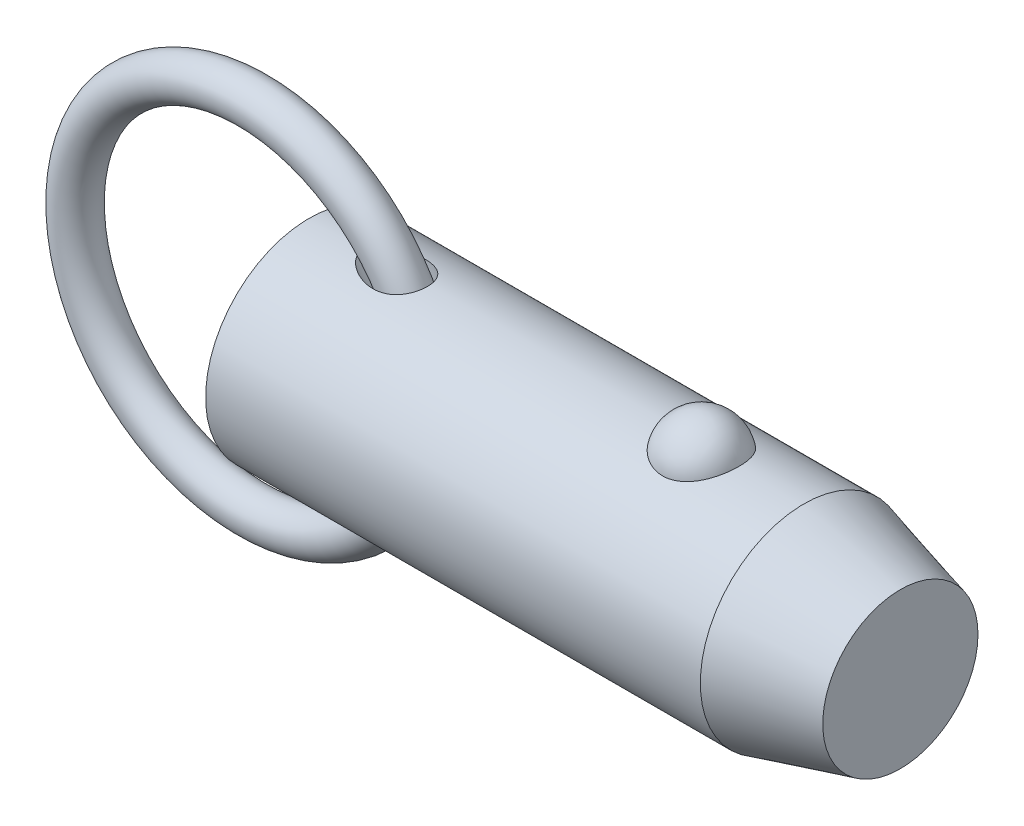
ISO-10303-21;
HEADER;
FILE_DESCRIPTION(('STEP AP214'),'2;1');
FILE_NAME('part.step','',(''),(''),'','','');
FILE_SCHEMA(('AUTOMOTIVE_DESIGN { 1 0 10303 214 1 1 1 1 }'));
ENDSEC;
DATA;
#1=APPLICATION_CONTEXT('core data for automotive mechanical design processes');
#2=APPLICATION_PROTOCOL_DEFINITION('international standard','automotive_design',2000,#1);
#3=PRODUCT_CONTEXT('',#1,'mechanical');
#4=PRODUCT('Part','Part','',(#3));
#5=PRODUCT_RELATED_PRODUCT_CATEGORY('part','',(#4));
#6=PRODUCT_DEFINITION_FORMATION('','',#4);
#7=PRODUCT_DEFINITION_CONTEXT('part definition',#1,'design');
#8=PRODUCT_DEFINITION('design','',#6,#7);
#9=PRODUCT_DEFINITION_SHAPE('','',#8);
#10=(LENGTH_UNIT() NAMED_UNIT(*) SI_UNIT(.MILLI.,.METRE.));
#11=(NAMED_UNIT(*) PLANE_ANGLE_UNIT() SI_UNIT($,.RADIAN.));
#12=(NAMED_UNIT(*) SI_UNIT($,.STERADIAN.) SOLID_ANGLE_UNIT());
#13=UNCERTAINTY_MEASURE_WITH_UNIT(LENGTH_MEASURE(1.E-05),#10,'distance_accuracy_value','');
#14=(GEOMETRIC_REPRESENTATION_CONTEXT(3) GLOBAL_UNCERTAINTY_ASSIGNED_CONTEXT((#13)) GLOBAL_UNIT_ASSIGNED_CONTEXT((#10,
#11,#12)) REPRESENTATION_CONTEXT('',''));
#15=CARTESIAN_POINT('',(0.,0.,0.));
#16=DIRECTION('',(0.,0.,1.));
#17=DIRECTION('',(1.,0.,0.));
#18=AXIS2_PLACEMENT_3D('',#15,#16,#17);
#19=CARTESIAN_POINT('',(-6.08699288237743,0.,0.));
#20=DIRECTION('',(0.,0.,1.));
#21=DIRECTION('',(1.,0.,0.));
#22=AXIS2_PLACEMENT_3D('',#19,#20,#21);
#23=TOROIDAL_SURFACE('',#22,19.05,2.223);
#24=CARTESIAN_POINT('',(15.1860071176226,0.,0.));
#25=VERTEX_POINT('',#24);
#26=VERTEX_LOOP('',#25);
#27=FACE_BOUND('',#26,.T.);
#28=ADVANCED_FACE('P0_F12',(#27),#23,.T.);
#29=CLOSED_SHELL('',(#28));
#30=MANIFOLD_SOLID_BREP('P0_B1',#29);
#31=CARTESIAN_POINT('',(0.,0.,0.));
#32=DIRECTION('',(1.,0.,0.));
#33=DIRECTION('',(0.,0.,-1.));
#34=AXIS2_PLACEMENT_3D('',#31,#32,#33);
#35=CYLINDRICAL_SURFACE('',#34,11.115);
#36=CARTESIAN_POINT('',(6.414051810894,11.0227946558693,-1.4287136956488));
#37=CARTESIAN_POINT('',(6.49338916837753,11.0115377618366,-1.51556642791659));
#38=CARTESIAN_POINT('',(6.57765461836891,10.9998263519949,-1.59789397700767));
#39=CARTESIAN_POINT('',(6.75386647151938,10.9760304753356,-1.75391400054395));
#40=CARTESIAN_POINT('',(6.84582247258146,10.9639455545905,-1.82759540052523));
#41=CARTESIAN_POINT('',(7.03627827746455,10.9397989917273,-1.96698954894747));
#42=CARTESIAN_POINT('',(7.13480838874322,10.9277377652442,-2.03266078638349));
#43=CARTESIAN_POINT('',(7.33681032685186,10.9041015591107,-2.1558582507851));
#44=CARTESIAN_POINT('',(7.44028007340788,10.8925263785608,-2.21338786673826));
#45=CARTESIAN_POINT('',(7.64386117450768,10.8710104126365,-2.31666528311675));
#46=CARTESIAN_POINT('',(7.74368989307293,10.8610119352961,-2.36295942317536));
#47=CARTESIAN_POINT('',(7.94637195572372,10.8420168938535,-2.44863486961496));
#48=CARTESIAN_POINT('',(8.04922612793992,10.8330206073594,-2.48801426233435));
#49=CARTESIAN_POINT('',(8.36115573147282,10.807980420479,-2.59542730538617));
#50=CARTESIAN_POINT('',(8.57411849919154,10.7938278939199,-2.65299817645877));
#51=CARTESIAN_POINT('',(9.00825016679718,10.7725818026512,-2.73800108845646));
#52=CARTESIAN_POINT('',(9.22947335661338,10.7655491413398,-2.76517330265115));
#53=CARTESIAN_POINT('',(9.67368141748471,10.7605872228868,-2.78445308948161));
#54=CARTESIAN_POINT('',(9.89666486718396,10.7626512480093,-2.77658653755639));
#55=CARTESIAN_POINT('',(10.2950172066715,10.7754452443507,-2.72644436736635));
#56=CARTESIAN_POINT('',(10.4712789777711,10.7844280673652,-2.69109376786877));
#57=CARTESIAN_POINT('',(10.7292776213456,10.8024982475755,-2.61722365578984));
#58=CARTESIAN_POINT('',(10.8142337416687,10.8092901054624,-2.58911576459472));
#59=CARTESIAN_POINT('',(10.9813218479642,10.8242580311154,-2.52581287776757));
#60=CARTESIAN_POINT('',(11.0634550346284,10.8324335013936,-2.49062094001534));
#61=CARTESIAN_POINT('',(11.2247418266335,10.8500287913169,-2.41281958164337));
#62=CARTESIAN_POINT('',(11.3038694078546,10.8594572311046,-2.37015806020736));
#63=CARTESIAN_POINT('',(11.4576781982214,10.8792243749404,-2.27770403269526));
#64=CARTESIAN_POINT('',(11.5323615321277,10.8895626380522,-2.22791497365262));
#65=CARTESIAN_POINT('',(11.6765388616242,10.9108113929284,-2.12140590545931));
#66=CARTESIAN_POINT('',(11.7460329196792,10.9217218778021,-2.06468597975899));
#67=CARTESIAN_POINT('',(11.8790597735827,10.9437207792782,-1.94471764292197));
#68=CARTESIAN_POINT('',(11.9425932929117,10.9548091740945,-1.88147002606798));
#69=CARTESIAN_POINT('',(12.109388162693,10.9851999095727,-1.69784918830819));
#70=CARTESIAN_POINT('',(12.205655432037,11.0042655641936,-1.57093023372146));
#71=CARTESIAN_POINT('',(12.374151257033,11.0393391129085,-1.3017676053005));
#72=CARTESIAN_POINT('',(12.4463875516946,11.0553479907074,-1.15952888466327));
#73=CARTESIAN_POINT('',(12.5615818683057,11.0816338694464,-0.87197217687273));
#74=CARTESIAN_POINT('',(12.6058896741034,11.0921698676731,-0.727217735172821));
#75=CARTESIAN_POINT('',(12.6699315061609,11.1075802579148,-0.432089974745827));
#76=CARTESIAN_POINT('',(12.6896681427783,11.1124552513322,-0.281717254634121));
#77=CARTESIAN_POINT('',(12.7040225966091,11.1159901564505,0.0188164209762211));
#78=CARTESIAN_POINT('',(12.6988836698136,11.1147102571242,0.168965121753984));
#79=CARTESIAN_POINT('',(12.6641681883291,11.1062126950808,0.466238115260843));
#80=CARTESIAN_POINT('',(12.6345920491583,11.0989951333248,0.613362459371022));
#81=CARTESIAN_POINT('',(12.5517453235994,11.0794095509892,0.900330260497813));
#82=CARTESIAN_POINT('',(12.4984878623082,11.0670443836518,1.0401777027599));
#83=CARTESIAN_POINT('',(12.3696588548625,11.0385082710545,1.308745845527));
#84=CARTESIAN_POINT('',(12.2940887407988,11.0223375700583,1.43746725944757));
#85=CARTESIAN_POINT('',(12.122380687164,10.987872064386,1.68079704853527));
#86=CARTESIAN_POINT('',(12.0261637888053,10.969569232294,1.79534850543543));
#87=CARTESIAN_POINT('',(11.8161707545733,10.932836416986,2.00695695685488));
#88=CARTESIAN_POINT('',(11.7023941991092,10.9144064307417,2.10401353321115));
#89=CARTESIAN_POINT('',(11.4575656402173,10.8788057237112,2.2810532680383));
#90=CARTESIAN_POINT('',(11.3261451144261,10.8616794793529,2.36053412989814));
#91=CARTESIAN_POINT('',(11.0523589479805,10.8308019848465,2.49839044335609));
#92=CARTESIAN_POINT('',(10.9099908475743,10.8170514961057,2.55676113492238));
#93=CARTESIAN_POINT('',(10.6060622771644,10.7929728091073,2.65666105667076));
#94=CARTESIAN_POINT('',(10.4438877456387,10.7830209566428,2.69640163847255));
#95=CARTESIAN_POINT('',(10.1154037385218,10.7687230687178,2.75293129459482));
#96=CARTESIAN_POINT('',(9.94909141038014,10.7643810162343,2.76970406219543));
#97=CARTESIAN_POINT('',(9.54387061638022,10.7604809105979,2.7848723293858));
#98=CARTESIAN_POINT('',(9.30446860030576,10.7637793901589,2.77227753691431));
#99=CARTESIAN_POINT('',(8.94961255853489,10.7757341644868,2.72524141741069));
#100=CARTESIAN_POINT('',(8.83186896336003,10.7808994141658,2.70482239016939));
#101=CARTESIAN_POINT('',(8.59835142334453,10.7932548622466,2.65509992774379));
#102=CARTESIAN_POINT('',(8.48257728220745,10.8004448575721,2.62579738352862));
#103=CARTESIAN_POINT('',(8.2520846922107,10.8166382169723,2.55827624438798));
#104=CARTESIAN_POINT('',(8.1374021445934,10.8256649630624,2.51994155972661));
#105=CARTESIAN_POINT('',(7.91132058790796,10.8451170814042,2.43486475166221));
#106=CARTESIAN_POINT('',(7.79992154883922,10.8555424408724,2.38812270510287));
#107=CARTESIAN_POINT('',(7.58115677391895,10.8774251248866,2.28638483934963));
#108=CARTESIAN_POINT('',(7.47378802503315,10.8888816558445,2.2313953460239));
#109=CARTESIAN_POINT('',(7.26385624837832,10.9124540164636,2.11310265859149));
#110=CARTESIAN_POINT('',(7.16129168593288,10.9245696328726,2.04980214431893));
#111=CARTESIAN_POINT('',(6.91882218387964,10.9543689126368,1.88540538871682));
#112=CARTESIAN_POINT('',(6.78193778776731,10.9721958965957,1.77979827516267));
#113=CARTESIAN_POINT('',(6.52472441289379,11.0070222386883,1.5498969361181));
#114=CARTESIAN_POINT('',(6.40436902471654,11.0240228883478,1.42563320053));
#115=CARTESIAN_POINT('',(6.21838804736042,11.0509658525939,1.19529359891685));
#116=CARTESIAN_POINT('',(6.14691885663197,11.0615430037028,1.09404520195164));
#117=CARTESIAN_POINT('',(6.02043496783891,11.0805004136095,0.881508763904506));
#118=CARTESIAN_POINT('',(5.96539400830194,11.0888841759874,0.770237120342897));
#119=CARTESIAN_POINT('',(5.88475453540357,11.1012553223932,0.560577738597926));
#120=CARTESIAN_POINT('',(5.85559643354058,11.1057686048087,0.463603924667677));
#121=CARTESIAN_POINT('',(5.81381299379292,11.1122523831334,0.26608330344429));
#122=CARTESIAN_POINT('',(5.80117118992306,11.1142254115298,0.165540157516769));
#123=CARTESIAN_POINT('',(5.79363815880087,11.1153999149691,-0.0364747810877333));
#124=CARTESIAN_POINT('',(5.79878799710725,11.1145949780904,-0.137948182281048));
#125=CARTESIAN_POINT('',(5.82639592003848,11.1102987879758,-0.338493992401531));
#126=CARTESIAN_POINT('',(5.84887234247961,11.1068046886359,-0.437563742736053));
#127=CARTESIAN_POINT('',(5.91510741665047,11.0965857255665,-0.649968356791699));
#128=CARTESIAN_POINT('',(5.9622090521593,11.0893566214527,-0.762222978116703));
#129=CARTESIAN_POINT('',(6.07378449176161,11.072471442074,-0.977396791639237));
#130=CARTESIAN_POINT('',(6.13826787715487,11.0628140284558,-1.08031079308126));
#131=CARTESIAN_POINT('',(6.24101077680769,11.0477136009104,-1.2219580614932));
#132=CARTESIAN_POINT('',(6.27403486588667,11.042895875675,-1.26469183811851));
#133=CARTESIAN_POINT('',(6.34238022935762,11.0330152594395,-1.34817011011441));
#134=CARTESIAN_POINT('',(6.37769867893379,11.0279526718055,-1.38891694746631));
#135=CARTESIAN_POINT('',(6.414051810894,11.0227946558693,-1.4287136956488));
#136=B_SPLINE_CURVE_WITH_KNOTS('',3,(#36,#37,#38,#39,#40,#41,#42,#43,#44,#45,#46,#47,#48,#49,
#50,#51,#52,#53,#54,#55,#56,#57,#58,#59,#60,#61,#62,#63,#64,#65,#66,#67,#68,#69,#70,#71,#72,#73,
#74,#75,#76,#77,#78,#79,#80,#81,#82,#83,#84,#85,#86,#87,#88,#89,#90,#91,#92,#93,#94,#95,#96,#97,
#98,#99,#100,#101,#102,#103,#104,#105,#106,#107,#108,#109,#110,#111,#112,#113,#114,#115,#116,
#117,#118,#119,#120,#121,#122,#123,#124,#125,#126,#127,#128,#129,#130,#131,#132,#133,#134,#135),
.UNSPECIFIED.,.T.,.F.,(4,2,2,2,2,2,2,2,2,2,2,2,2,2,2,2,2,2,2,2,2,2,2,2,2,2,2,2,2,2,2,2,2,2,2,2,
2,2,2,2,2,2,2,2,2,2,2,2,2,4),(0.,0.35443329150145,0.709315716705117,1.0659654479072,
1.42246628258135,1.7536715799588,2.08496839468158,2.74582009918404,3.41227815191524,
4.07824412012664,4.61583787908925,4.88478112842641,5.1536085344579,5.42439170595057,
5.69504436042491,5.96569375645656,6.23631025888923,6.71490729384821,7.19335005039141,
7.64641437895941,8.09943057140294,8.54802575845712,8.99661331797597,9.44495256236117,
9.89326303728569,10.3433195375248,10.7933867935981,11.2550086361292,11.7167345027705,
12.2165866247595,12.7167934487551,13.4318876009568,13.7904664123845,14.1490092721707,
14.5124394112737,14.8758662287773,15.239015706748,15.6020483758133,16.1219860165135,
16.6410830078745,17.0130520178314,17.3844231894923,17.6872330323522,17.9897407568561,
18.2929471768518,18.5964749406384,18.9603532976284,19.3244326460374,19.4870338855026,
19.649438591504),.UNSPECIFIED.);
#137=CARTESIAN_POINT('',(6.414051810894,11.0227946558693,-1.4287136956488));
#138=VERTEX_POINT('',#137);
#139=EDGE_CURVE('P1_E40',#138,#138,#136,.T.);
#140=ORIENTED_EDGE('',*,*,#139,.T.);
#141=EDGE_LOOP('',(#140));
#142=FACE_BOUND('',#141,.T.);
#143=CARTESIAN_POINT('',(53.129563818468,0.,0.));
#144=DIRECTION('',(1.,0.,0.));
#145=DIRECTION('',(0.,0.,-1.));
#146=AXIS2_PLACEMENT_3D('',#143,#144,#145);
#147=CIRCLE('',#146,11.115);
#148=CARTESIAN_POINT('',(53.129563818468,0.,-11.115));
#149=VERTEX_POINT('',#148);
#150=EDGE_CURVE('P1_E25',#149,#149,#147,.T.);
#151=ORIENTED_EDGE('',*,*,#150,.F.);
#152=EDGE_LOOP('',(#151));
#153=FACE_BOUND('',#152,.T.);
#154=CARTESIAN_POINT('',(0.,0.,0.));
#155=DIRECTION('',(1.,0.,0.));
#156=DIRECTION('',(0.,0.,-1.));
#157=AXIS2_PLACEMENT_3D('',#154,#155,#156);
#158=CIRCLE('',#157,11.115);
#159=CARTESIAN_POINT('',(0.,0.,-11.115));
#160=VERTEX_POINT('',#159);
#161=EDGE_CURVE('P1_E9',#160,#160,#158,.T.);
#162=ORIENTED_EDGE('',*,*,#161,.T.);
#163=EDGE_LOOP('',(#162));
#164=FACE_BOUND('',#163,.T.);
#165=CARTESIAN_POINT('',(42.1310680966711,10.3028087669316,4.17077409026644));
#166=CARTESIAN_POINT('',(41.9147756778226,10.3028003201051,4.17078240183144));
#167=CARTESIAN_POINT('',(41.6985488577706,10.3098895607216,4.15340593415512));
#168=CARTESIAN_POINT('',(41.2725408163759,10.3373834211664,4.08449540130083));
#169=CARTESIAN_POINT('',(41.0627577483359,10.3577841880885,4.03297121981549));
#170=CARTESIAN_POINT('',(40.6557825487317,10.4095237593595,3.89746513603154));
#171=CARTESIAN_POINT('',(40.4585726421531,10.4408466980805,3.8135302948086));
#172=CARTESIAN_POINT('',(40.0813382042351,10.5110236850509,3.61560339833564));
#173=CARTESIAN_POINT('',(39.9013171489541,10.5498792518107,3.50160528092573));
#174=CARTESIAN_POINT('',(39.5576842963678,10.6322884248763,3.24292464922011));
#175=CARTESIAN_POINT('',(39.3946861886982,10.6759443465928,3.09746040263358));
#176=CARTESIAN_POINT('',(39.0945911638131,10.7625291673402,2.78171925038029));
#177=CARTESIAN_POINT('',(38.9574990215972,10.8054579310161,2.61143778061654));
#178=CARTESIAN_POINT('',(38.7064084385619,10.8881935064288,2.24226695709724));
#179=CARTESIAN_POINT('',(38.5937105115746,10.9277761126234,2.04244123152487));
#180=CARTESIAN_POINT('',(38.4017771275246,10.997484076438,1.62578254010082));
#181=CARTESIAN_POINT('',(38.322544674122,11.0276085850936,1.40894804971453));
#182=CARTESIAN_POINT('',(38.1983034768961,11.0756732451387,0.961250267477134));
#183=CARTESIAN_POINT('',(38.153760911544,11.0934470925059,0.730239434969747));
#184=CARTESIAN_POINT('',(38.1015695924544,11.1143331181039,0.263439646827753));
#185=CARTESIAN_POINT('',(38.0939200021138,11.1174456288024,0.027650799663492));
#186=CARTESIAN_POINT('',(38.1156105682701,11.1087161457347,-0.440729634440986));
#187=CARTESIAN_POINT('',(38.1447624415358,11.0969502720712,-0.673331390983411));
#188=CARTESIAN_POINT('',(38.2391432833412,11.0597872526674,-1.12996621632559));
#189=CARTESIAN_POINT('',(38.3043729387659,11.0343898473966,-1.35399912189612));
#190=CARTESIAN_POINT('',(38.4696984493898,10.972515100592,-1.78750286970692));
#191=CARTESIAN_POINT('',(38.5698386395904,10.9360236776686,-1.99695478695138));
#192=CARTESIAN_POINT('',(38.8029408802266,10.8557595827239,-2.39520667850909));
#193=CARTESIAN_POINT('',(38.9359054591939,10.8119863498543,-2.5840050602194));
#194=CARTESIAN_POINT('',(39.232407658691,10.7216733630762,-2.93635726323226));
#195=CARTESIAN_POINT('',(39.3960565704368,10.675123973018,-3.09981510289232));
#196=CARTESIAN_POINT('',(39.7498601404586,10.5846571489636,-3.39592247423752));
#197=CARTESIAN_POINT('',(39.9400123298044,10.5407394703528,-3.52857487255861));
#198=CARTESIAN_POINT('',(40.3375014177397,10.4616690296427,-3.75646057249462));
#199=CARTESIAN_POINT('',(40.5443670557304,10.4263443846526,-3.8524543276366));
#200=CARTESIAN_POINT('',(40.9729541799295,10.3675574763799,-4.00798747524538));
#201=CARTESIAN_POINT('',(41.194670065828,10.344090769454,-4.0675405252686));
#202=CARTESIAN_POINT('',(41.6346695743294,10.3128282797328,-4.14614314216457));
#203=CARTESIAN_POINT('',(41.8525654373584,10.3043040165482,-4.16707833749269));
#204=CARTESIAN_POINT('',(42.2889495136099,10.3016771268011,-4.17357158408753));
#205=CARTESIAN_POINT('',(42.5074376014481,10.3075716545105,-4.15913661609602));
#206=CARTESIAN_POINT('',(42.9317442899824,10.3326686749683,-4.09636961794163));
#207=CARTESIAN_POINT('',(43.1377458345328,10.3514555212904,-4.0490957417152));
#208=CARTESIAN_POINT('',(43.5385764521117,10.399818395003,-3.92320197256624));
#209=CARTESIAN_POINT('',(43.7334046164,10.4293952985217,-3.84457953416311));
#210=CARTESIAN_POINT('',(44.1111917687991,10.4969600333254,-3.65612410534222));
#211=CARTESIAN_POINT('',(44.2937974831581,10.5351178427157,-3.54564545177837));
#212=CARTESIAN_POINT('',(44.6382040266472,10.6154999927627,-3.29718036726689));
#213=CARTESIAN_POINT('',(44.800000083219,10.657725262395,-3.15918764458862));
#214=CARTESIAN_POINT('',(45.1069596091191,10.744212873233,-2.85163580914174));
#215=CARTESIAN_POINT('',(45.2508919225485,10.7884718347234,-2.68084605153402));
#216=CARTESIAN_POINT('',(45.5092371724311,10.872374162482,-2.3172186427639));
#217=CARTESIAN_POINT('',(45.6236448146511,10.9120167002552,-2.12437704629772));
#218=CARTESIAN_POINT('',(45.8238739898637,10.9838919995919,-1.71516999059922));
#219=CARTESIAN_POINT('',(45.9086617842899,11.0158465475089,-1.498248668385));
#220=CARTESIAN_POINT('',(46.0426838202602,11.0673523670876,-1.05228572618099));
#221=CARTESIAN_POINT('',(46.0919174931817,11.086903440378,-0.823243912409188));
#222=CARTESIAN_POINT('',(46.1538915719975,11.1116323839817,-0.359087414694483));
#223=CARTESIAN_POINT('',(46.1665662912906,11.1167843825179,-0.123962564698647));
#224=CARTESIAN_POINT('',(46.154973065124,11.1121144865,0.345220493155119));
#225=CARTESIAN_POINT('',(46.1307056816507,11.1022928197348,0.579278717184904));
#226=CARTESIAN_POINT('',(46.0459073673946,11.0687504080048,1.03866534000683));
#227=CARTESIAN_POINT('',(45.9855299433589,11.0450885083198,1.26402641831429));
#228=CARTESIAN_POINT('',(45.8298532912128,10.9863185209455,1.70076772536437));
#229=CARTESIAN_POINT('',(45.734551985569,10.9512097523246,1.91214712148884));
#230=CARTESIAN_POINT('',(45.5103974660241,10.8729733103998,2.31608359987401));
#231=CARTESIAN_POINT('',(45.3813806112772,10.8298068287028,2.50854240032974));
#232=CARTESIAN_POINT('',(45.0927327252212,10.7401896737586,2.86808766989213));
#233=CARTESIAN_POINT('',(44.9331022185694,10.6937390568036,3.03517457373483));
#234=CARTESIAN_POINT('',(44.5875341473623,10.6029321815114,3.33857581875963));
#235=CARTESIAN_POINT('',(44.4017089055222,10.5585680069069,3.47501541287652));
#236=CARTESIAN_POINT('',(44.0078750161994,10.4769321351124,3.71390897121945));
#237=CARTESIAN_POINT('',(43.7998635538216,10.439661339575,3.81635861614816));
#238=CARTESIAN_POINT('',(43.3540666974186,10.3749407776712,3.98910631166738));
#239=CARTESIAN_POINT('',(43.1152342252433,10.3482457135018,4.05700929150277));
#240=CARTESIAN_POINT('',(42.6279254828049,10.312188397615,4.14782844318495));
#241=CARTESIAN_POINT('',(42.3794535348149,10.3028184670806,4.17076454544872));
#242=CARTESIAN_POINT('',(42.1310680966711,10.3028087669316,4.17077409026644));
#243=B_SPLINE_CURVE_WITH_KNOTS('',3,(#165,#166,#167,#168,#169,#170,#171,#172,#173,#174,#175,
#176,#177,#178,#179,#180,#181,#182,#183,#184,#185,#186,#187,#188,#189,#190,#191,#192,#193,#194,
#195,#196,#197,#198,#199,#200,#201,#202,#203,#204,#205,#206,#207,#208,#209,#210,#211,#212,#213,
#214,#215,#216,#217,#218,#219,#220,#221,#222,#223,#224,#225,#226,#227,#228,#229,#230,#231,#232,
#233,#234,#235,#236,#237,#238,#239,#240,#241,#242),.UNSPECIFIED.,.T.,.F.,(4,2,2,2,2,2,2,2,2,2,2,
2,2,2,2,2,2,2,2,2,2,2,2,2,2,2,2,2,2,2,2,2,2,2,2,2,2,2,4),(0.,0.647966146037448,1.29574482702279,
1.94258643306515,2.58955857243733,3.25496465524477,3.92049326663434,4.61566368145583,
5.31089647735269,6.01531821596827,6.71972398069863,7.42054043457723,8.12137023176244,
8.8230933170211,9.5248704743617,10.2292439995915,10.9335519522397,11.6223330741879,
12.3108558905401,12.9647664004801,13.6185478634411,14.252184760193,14.8858731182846,
15.5334360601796,16.1811472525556,16.8611459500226,17.5412664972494,18.2431855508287,
18.9451158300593,19.6483065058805,20.3514864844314,21.0516982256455,21.7519516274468,
22.4556690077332,23.1593743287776,23.860149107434,24.5610129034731,25.3054529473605,
26.049562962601),.UNSPECIFIED.);
#244=CARTESIAN_POINT('',(42.1310680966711,10.3028087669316,4.17077409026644));
#245=VERTEX_POINT('',#244);
#246=EDGE_CURVE('P1_E34',#245,#245,#243,.T.);
#247=ORIENTED_EDGE('',*,*,#246,.T.);
#248=EDGE_LOOP('',(#247));
#249=FACE_BOUND('',#248,.T.);
#250=CARTESIAN_POINT('',(6.414051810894,-11.0227946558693,-1.4287136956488));
#251=CARTESIAN_POINT('',(6.33124061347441,-11.0345445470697,-1.33806125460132));
#252=CARTESIAN_POINT('',(6.25372866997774,-11.0458090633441,-1.24240732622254));
#253=CARTESIAN_POINT('',(6.11277905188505,-11.0666115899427,-1.04095704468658));
#254=CARTESIAN_POINT('',(6.04933920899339,-11.0761498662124,-0.935162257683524));
#255=CARTESIAN_POINT('',(5.94029181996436,-11.0927063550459,-0.712476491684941));
#256=CARTESIAN_POINT('',(5.89492964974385,-11.0996897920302,-0.595457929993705));
#257=CARTESIAN_POINT('',(5.8449816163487,-11.1074141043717,-0.414997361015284));
#258=CARTESIAN_POINT('',(5.83135004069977,-11.1095300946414,-0.354047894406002));
#259=CARTESIAN_POINT('',(5.81051649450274,-11.1127688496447,-0.231041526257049));
#260=CARTESIAN_POINT('',(5.80331311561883,-11.1138918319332,-0.1689848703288));
#261=CARTESIAN_POINT('',(5.79296529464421,-11.1155042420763,-0.000484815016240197));
#262=CARTESIAN_POINT('',(5.79625267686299,-11.1149904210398,0.106437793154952));
#263=CARTESIAN_POINT('',(5.82213676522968,-11.1109609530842,0.317809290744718));
#264=CARTESIAN_POINT('',(5.84474662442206,-11.1074432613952,0.422256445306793));
#265=CARTESIAN_POINT('',(5.91113114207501,-11.097197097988,0.639361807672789));
#266=CARTESIAN_POINT('',(5.95733120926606,-11.090102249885,0.751250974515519));
#267=CARTESIAN_POINT('',(6.06709542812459,-11.0734770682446,0.965912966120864));
#268=CARTESIAN_POINT('',(6.13068735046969,-11.06394284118,1.06867085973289));
#269=CARTESIAN_POINT('',(6.30294237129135,-11.0385920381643,1.30890635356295));
#270=CARTESIAN_POINT('',(6.4189620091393,-11.0218881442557,1.44097376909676));
#271=CARTESIAN_POINT('',(6.66989654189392,-10.9871512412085,1.68553954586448));
#272=CARTESIAN_POINT('',(6.80485520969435,-10.9691152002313,1.79799117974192));
#273=CARTESIAN_POINT('',(7.04881236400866,-10.9382283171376,1.97587596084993));
#274=CARTESIAN_POINT('',(7.15465712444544,-10.9253240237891,2.04570822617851));
#275=CARTESIAN_POINT('',(7.37202504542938,-10.9000987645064,2.17611840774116));
#276=CARTESIAN_POINT('',(7.48355057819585,-10.8877780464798,2.23669241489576));
#277=CARTESIAN_POINT('',(7.71132418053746,-10.8641580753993,2.34873831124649));
#278=CARTESIAN_POINT('',(7.82757727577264,-10.8528599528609,2.40020018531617));
#279=CARTESIAN_POINT('',(8.06386825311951,-10.8317234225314,2.49385169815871));
#280=CARTESIAN_POINT('',(8.18390558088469,-10.8218848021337,2.53604268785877));
#281=CARTESIAN_POINT('',(8.42918336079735,-10.8039208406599,2.61152283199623));
#282=CARTESIAN_POINT('',(8.55447802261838,-10.7958283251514,2.64464414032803));
#283=CARTESIAN_POINT('',(8.80752127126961,-10.781995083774,2.70048793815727));
#284=CARTESIAN_POINT('',(8.93527019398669,-10.7762546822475,2.72320899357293));
#285=CARTESIAN_POINT('',(9.19210176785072,-10.7675291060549,2.75750994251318));
#286=CARTESIAN_POINT('',(9.32118105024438,-10.7645381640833,2.76911315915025));
#287=CARTESIAN_POINT('',(9.57984338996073,-10.761622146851,2.78042035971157));
#288=CARTESIAN_POINT('',(9.70942621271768,-10.7616957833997,2.78012934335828));
#289=CARTESIAN_POINT('',(10.0243125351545,-10.7659059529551,2.76381534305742));
#290=CARTESIAN_POINT('',(10.209307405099,-10.7717977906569,2.74099674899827));
#291=CARTESIAN_POINT('',(10.5731188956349,-10.7905408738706,2.66626238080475));
#292=CARTESIAN_POINT('',(10.7519389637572,-10.8033881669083,2.61436313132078));
#293=CARTESIAN_POINT('',(11.0114289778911,-10.8271584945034,2.51336808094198));
#294=CARTESIAN_POINT('',(11.0968318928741,-10.835881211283,2.47562331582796));
#295=CARTESIAN_POINT('',(11.2636000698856,-10.8545688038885,2.39236170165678));
#296=CARTESIAN_POINT('',(11.344967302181,-10.8645330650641,2.34684869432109));
#297=CARTESIAN_POINT('',(11.5027832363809,-10.8853818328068,2.24815967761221));
#298=CARTESIAN_POINT('',(11.5792327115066,-10.8962661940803,2.19498487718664));
#299=CARTESIAN_POINT('',(11.7263315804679,-10.9185541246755,2.08128855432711));
#300=CARTESIAN_POINT('',(11.7969818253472,-10.9299576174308,2.02076811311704));
#301=CARTESIAN_POINT('',(11.9817953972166,-10.9613645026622,1.84513663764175));
#302=CARTESIAN_POINT('',(12.0893012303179,-10.9814643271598,1.72286660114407));
#303=CARTESIAN_POINT('',(12.2803576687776,-11.0193991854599,1.46066991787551));
#304=CARTESIAN_POINT('',(12.3639173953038,-11.0372350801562,1.32075002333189));
#305=CARTESIAN_POINT('',(12.4996220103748,-11.0672969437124,1.03778067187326));
#306=CARTESIAN_POINT('',(12.5535315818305,-11.0798242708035,0.895607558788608));
#307=CARTESIAN_POINT('',(12.636874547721,-11.0995427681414,0.603918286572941));
#308=CARTESIAN_POINT('',(12.6663115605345,-11.1067347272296,0.454403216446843));
#309=CARTESIAN_POINT('',(12.6997387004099,-11.1149224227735,0.154577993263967));
#310=CARTESIAN_POINT('',(12.7040886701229,-11.1160057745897,0.00431019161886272));
#311=CARTESIAN_POINT('',(12.6882048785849,-11.1120956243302,-0.294841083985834));
#312=CARTESIAN_POINT('',(12.6679715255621,-11.1071022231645,-0.443724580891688));
#313=CARTESIAN_POINT('',(12.6034470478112,-11.0915888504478,-0.735688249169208));
#314=CARTESIAN_POINT('',(12.5591858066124,-11.0810757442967,-0.878775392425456));
#315=CARTESIAN_POINT('',(12.4477416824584,-11.0556687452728,-1.1552952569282));
#316=CARTESIAN_POINT('',(12.3805601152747,-11.0407751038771,-1.28872853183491));
#317=CARTESIAN_POINT('',(12.2248919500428,-11.0081839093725,-1.54257976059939));
#318=CARTESIAN_POINT('',(12.1363549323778,-10.9904797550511,-1.66296592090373));
#319=CARTESIAN_POINT('',(11.9406137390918,-10.9541951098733,-1.88726577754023));
#320=CARTESIAN_POINT('',(11.833409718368,-10.9356146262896,-1.99117961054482));
#321=CARTESIAN_POINT('',(11.601318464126,-10.8991360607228,-2.18213646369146));
#322=CARTESIAN_POINT('',(11.4761325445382,-10.8812577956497,-2.26881927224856));
#323=CARTESIAN_POINT('',(11.2134852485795,-10.8482871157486,-2.42157282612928));
#324=CARTESIAN_POINT('',(11.0760218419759,-10.8331951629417,-2.48764015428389));
#325=CARTESIAN_POINT('',(10.7828968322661,-10.8061050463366,-2.60290068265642));
#326=CARTESIAN_POINT('',(10.6266338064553,-10.7943907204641,-2.65062248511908));
#327=CARTESIAN_POINT('',(10.3086617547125,-10.7762429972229,-2.72345054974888));
#328=CARTESIAN_POINT('',(10.146948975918,-10.7698133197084,-2.74854088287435));
#329=CARTESIAN_POINT('',(9.75541304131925,-10.7608036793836,-2.78368719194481));
#330=CARTESIAN_POINT('',(9.52459435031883,-10.7608467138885,-2.78350276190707));
#331=CARTESIAN_POINT('',(9.0660496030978,-10.7702674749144,-2.74677945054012));
#332=CARTESIAN_POINT('',(8.83832966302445,-10.7796615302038,-2.71017697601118));
#333=CARTESIAN_POINT('',(8.38783466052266,-10.8058248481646,-2.60392490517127));
#334=CARTESIAN_POINT('',(8.16517101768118,-10.8226939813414,-2.53382676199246));
#335=CARTESIAN_POINT('',(7.84087311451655,-10.8516548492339,-2.40555545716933));
#336=CARTESIAN_POINT('',(7.73435551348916,-10.8619221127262,-2.35892455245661));
#337=CARTESIAN_POINT('',(7.52510420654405,-10.883357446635,-2.25797017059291));
#338=CARTESIAN_POINT('',(7.42236986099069,-10.8945253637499,-2.20364800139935));
#339=CARTESIAN_POINT('',(7.23808758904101,-10.915528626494,-2.09688018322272));
#340=CARTESIAN_POINT('',(7.15584631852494,-10.9252787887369,-2.04561072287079));
#341=CARTESIAN_POINT('',(6.99510576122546,-10.944960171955,-1.93754729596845));
#342=CARTESIAN_POINT('',(6.91660574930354,-10.9548913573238,-1.88075440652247));
#343=CARTESIAN_POINT('',(6.76418133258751,-10.974690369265,-1.7615450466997));
#344=CARTESIAN_POINT('',(6.69024940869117,-10.984558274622,-1.69913825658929));
#345=CARTESIAN_POINT('',(6.54780119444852,-11.0039826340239,-1.56842485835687));
#346=CARTESIAN_POINT('',(6.47928247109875,-11.0135392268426,-1.50012092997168));
#347=CARTESIAN_POINT('',(6.414051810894,-11.0227946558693,-1.4287136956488));
#348=B_SPLINE_CURVE_WITH_KNOTS('',3,(#250,#251,#252,#253,#254,#255,#256,#257,#258,#259,#260,
#261,#262,#263,#264,#265,#266,#267,#268,#269,#270,#271,#272,#273,#274,#275,#276,#277,#278,#279,
#280,#281,#282,#283,#284,#285,#286,#287,#288,#289,#290,#291,#292,#293,#294,#295,#296,#297,#298,
#299,#300,#301,#302,#303,#304,#305,#306,#307,#308,#309,#310,#311,#312,#313,#314,#315,#316,#317,
#318,#319,#320,#321,#322,#323,#324,#325,#326,#327,#328,#329,#330,#331,#332,#333,#334,#335,#336,
#337,#338,#339,#340,#341,#342,#343,#344,#345,#346,#347),.UNSPECIFIED.,.T.,.F.,(4,2,2,2,2,2,2,2,
2,2,2,2,2,2,2,2,2,2,2,2,2,2,2,2,2,2,2,2,2,2,2,2,2,2,2,2,2,2,2,2,2,2,2,2,2,2,2,2,4),(0.,
0.36983565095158,0.739614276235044,1.1142538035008,1.30141910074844,1.48854338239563,
1.8074587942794,2.12659146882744,2.4883888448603,2.85076733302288,3.3776216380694,
3.90571433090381,4.287639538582,4.66972556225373,5.05222896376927,5.43467659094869,
5.82378546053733,6.21294796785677,6.6012922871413,6.98947336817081,7.54669558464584,
8.10360148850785,8.3845853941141,8.66543074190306,8.94623182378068,9.22699162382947,
9.71628887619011,10.2053995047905,10.6608871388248,11.1163074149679,11.5651786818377,
12.0140424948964,12.4623493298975,12.9106304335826,13.3599804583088,13.8093267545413,
14.2672570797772,14.7252632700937,15.214740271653,15.7045615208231,16.3932594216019,
17.083162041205,17.7825738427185,18.1325177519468,18.4824022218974,18.7744056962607,
19.0663523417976,19.3578048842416,19.6491256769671),.UNSPECIFIED.);
#349=CARTESIAN_POINT('',(6.414051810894,-11.0227946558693,-1.4287136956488));
#350=VERTEX_POINT('',#349);
#351=EDGE_CURVE('P1_E17',#350,#350,#348,.T.);
#352=ORIENTED_EDGE('',*,*,#351,.T.);
#353=EDGE_LOOP('',(#352));
#354=FACE_BOUND('',#353,.T.);
#355=ADVANCED_FACE('P1_F13',(#142,#153,#164,#249,#354),#35,.T.);
#356=CARTESIAN_POINT('',(0.,0.,0.));
#357=DIRECTION('',(-1.,0.,0.));
#358=DIRECTION('',(0.,0.,1.));
#359=AXIS2_PLACEMENT_3D('',#356,#357,#358);
#360=PLANE('',#359);
#361=ORIENTED_EDGE('',*,*,#161,.F.);
#362=EDGE_LOOP('',(#361));
#363=FACE_BOUND('',#362,.T.);
#364=ADVANCED_FACE('P1_F15',(#363),#360,.T.);
#365=CARTESIAN_POINT('',(63.5,0.,0.));
#366=DIRECTION('',(-1.,0.,0.));
#367=DIRECTION('',(0.,0.,1.));
#368=AXIS2_PLACEMENT_3D('',#365,#366,#367);
#369=CONICAL_SURFACE('',#368,8.33625000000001,0.26179938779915);
#370=ORIENTED_EDGE('',*,*,#150,.T.);
#371=EDGE_LOOP('',(#370));
#372=FACE_BOUND('',#371,.T.);
#373=CARTESIAN_POINT('',(63.5,0.,0.));
#374=DIRECTION('',(1.,0.,0.));
#375=DIRECTION('',(0.,0.,-1.));
#376=AXIS2_PLACEMENT_3D('',#373,#374,#375);
#377=CIRCLE('',#376,8.33625000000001);
#378=CARTESIAN_POINT('',(63.5,0.,-8.33625000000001));
#379=VERTEX_POINT('',#378);
#380=EDGE_CURVE('P1_E30',#379,#379,#377,.T.);
#381=ORIENTED_EDGE('',*,*,#380,.F.);
#382=EDGE_LOOP('',(#381));
#383=FACE_BOUND('',#382,.T.);
#384=ADVANCED_FACE('P1_F55',(#372,#383),#369,.T.);
#385=CARTESIAN_POINT('',(63.5,8.33625000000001,0.));
#386=DIRECTION('',(1.,0.,0.));
#387=DIRECTION('',(0.,0.,-1.));
#388=AXIS2_PLACEMENT_3D('',#385,#386,#387);
#389=PLANE('',#388);
#390=ORIENTED_EDGE('',*,*,#380,.T.);
#391=EDGE_LOOP('',(#390));
#392=FACE_BOUND('',#391,.T.);
#393=ADVANCED_FACE('P1_F51',(#392),#389,.T.);
#394=CARTESIAN_POINT('',(42.1310680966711,10.0035,0.));
#395=DIRECTION('',(-1.,0.,0.));
#396=DIRECTION('',(0.,1.,0.));
#397=AXIS2_PLACEMENT_3D('',#394,#395,#396);
#398=SPHERICAL_SURFACE('',#397,4.1815);
#399=ORIENTED_EDGE('',*,*,#246,.F.);
#400=EDGE_LOOP('',(#399));
#401=FACE_BOUND('',#400,.T.);
#402=ADVANCED_FACE('P1_F46',(#401),#398,.T.);
#403=CARTESIAN_POINT('',(-6.08699288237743,0.,0.));
#404=DIRECTION('',(0.,0.,1.));
#405=DIRECTION('',(1.,0.,0.));
#406=AXIS2_PLACEMENT_3D('',#403,#404,#405);
#407=TOROIDAL_SURFACE('',#406,19.05,2.77875);
#408=ORIENTED_EDGE('',*,*,#351,.F.);
#409=EDGE_LOOP('',(#408));
#410=FACE_BOUND('',#409,.T.);
#411=ORIENTED_EDGE('',*,*,#139,.F.);
#412=EDGE_LOOP('',(#411));
#413=FACE_BOUND('',#412,.T.);
#414=ADVANCED_FACE('P1_F50',(#410,#413),#407,.F.);
#415=CLOSED_SHELL('',(#355,#364,#384,#393,#402,#414));
#416=MANIFOLD_SOLID_BREP('P1_B1',#415);
#417=ADVANCED_BREP_SHAPE_REPRESENTATION('',(#18,#30,#416),#14);
#418=SHAPE_DEFINITION_REPRESENTATION(#9,#417);
ENDSEC;
END-ISO-10303-21;
